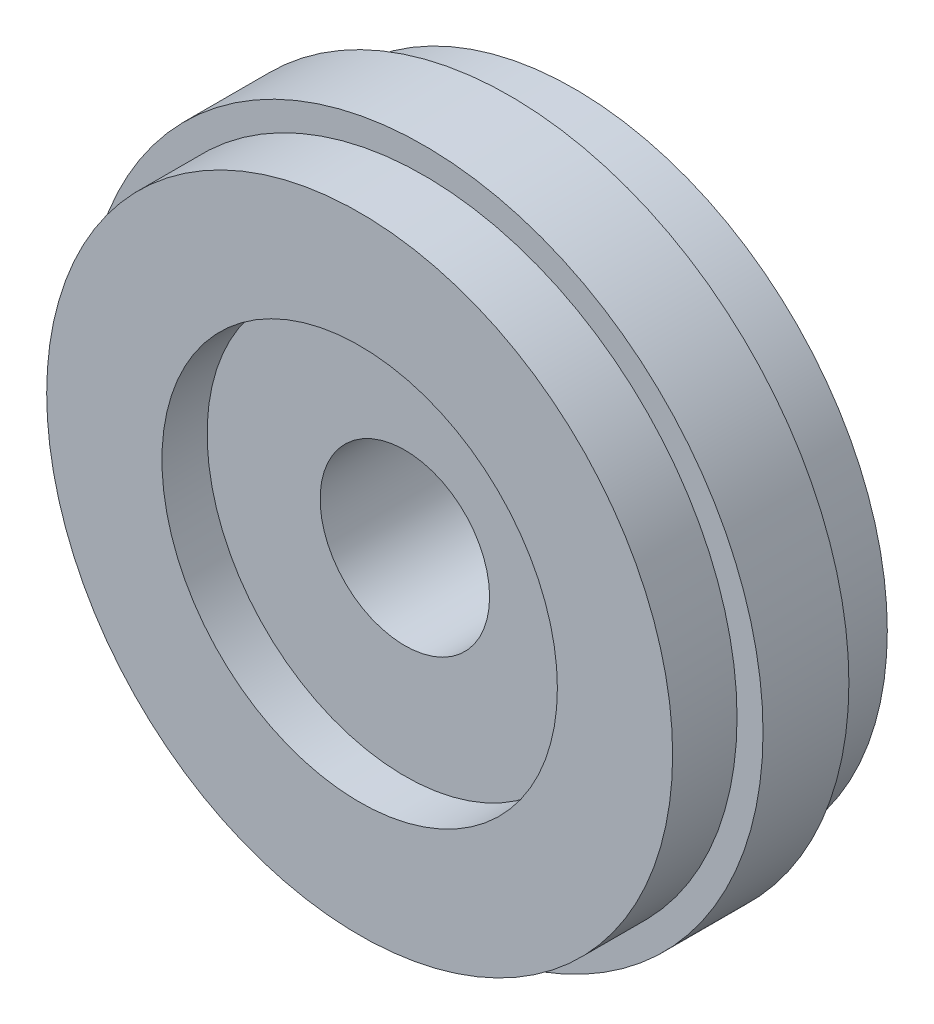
ISO-10303-21;
HEADER;
FILE_DESCRIPTION(('STEP AP214'),'2;1');
FILE_NAME('part.step','',(''),(''),'','','');
FILE_SCHEMA(('AUTOMOTIVE_DESIGN { 1 0 10303 214 1 1 1 1 }'));
ENDSEC;
DATA;
#1=APPLICATION_CONTEXT('core data for automotive mechanical design processes');
#2=APPLICATION_PROTOCOL_DEFINITION('international standard','automotive_design',2000,#1);
#3=PRODUCT_CONTEXT('',#1,'mechanical');
#4=PRODUCT('Part','Part','',(#3));
#5=PRODUCT_RELATED_PRODUCT_CATEGORY('part','',(#4));
#6=PRODUCT_DEFINITION_FORMATION('','',#4);
#7=PRODUCT_DEFINITION_CONTEXT('part definition',#1,'design');
#8=PRODUCT_DEFINITION('design','',#6,#7);
#9=PRODUCT_DEFINITION_SHAPE('','',#8);
#10=(LENGTH_UNIT() NAMED_UNIT(*) SI_UNIT(.MILLI.,.METRE.));
#11=(NAMED_UNIT(*) PLANE_ANGLE_UNIT() SI_UNIT($,.RADIAN.));
#12=(NAMED_UNIT(*) SI_UNIT($,.STERADIAN.) SOLID_ANGLE_UNIT());
#13=UNCERTAINTY_MEASURE_WITH_UNIT(LENGTH_MEASURE(1.E-05),#10,'distance_accuracy_value','');
#14=(GEOMETRIC_REPRESENTATION_CONTEXT(3) GLOBAL_UNCERTAINTY_ASSIGNED_CONTEXT((#13)) GLOBAL_UNIT_ASSIGNED_CONTEXT((#10,
#11,#12)) REPRESENTATION_CONTEXT('',''));
#15=CARTESIAN_POINT('',(0.,0.,0.));
#16=DIRECTION('',(0.,0.,1.));
#17=DIRECTION('',(1.,0.,0.));
#18=AXIS2_PLACEMENT_3D('',#15,#16,#17);
#19=CARTESIAN_POINT('',(0.,14.5,-9.5));
#20=DIRECTION('',(0.,0.,1.));
#21=DIRECTION('',(1.,0.,0.));
#22=AXIS2_PLACEMENT_3D('',#19,#20,#21);
#23=PLANE('',#22);
#24=CARTESIAN_POINT('',(0.,0.,-9.5));
#25=DIRECTION('',(0.,0.,1.));
#26=DIRECTION('',(1.,0.,0.));
#27=AXIS2_PLACEMENT_3D('',#24,#25,#26);
#28=CIRCLE('',#27,14.5);
#29=CARTESIAN_POINT('',(14.5,0.,-9.5));
#30=VERTEX_POINT('',#29);
#31=EDGE_CURVE('E8',#30,#30,#28,.T.);
#32=ORIENTED_EDGE('',*,*,#31,.T.);
#33=EDGE_LOOP('',(#32));
#34=FACE_BOUND('',#33,.T.);
#35=CARTESIAN_POINT('',(0.,0.,-9.5));
#36=DIRECTION('',(0.,0.,1.));
#37=DIRECTION('',(1.,0.,0.));
#38=AXIS2_PLACEMENT_3D('',#35,#36,#37);
#39=CIRCLE('',#38,27.7);
#40=CARTESIAN_POINT('',(27.7,0.,-9.5));
#41=VERTEX_POINT('',#40);
#42=EDGE_CURVE('E15',#41,#41,#39,.T.);
#43=ORIENTED_EDGE('',*,*,#42,.F.);
#44=EDGE_LOOP('',(#43));
#45=FACE_BOUND('',#44,.T.);
#46=ADVANCED_FACE('F12',(#34,#45),#23,.F.);
#47=CARTESIAN_POINT('',(0.,30.,9.5));
#48=DIRECTION('',(0.,0.,-1.));
#49=DIRECTION('',(-1.,0.,0.));
#50=AXIS2_PLACEMENT_3D('',#47,#48,#49);
#51=PLANE('',#50);
#52=CARTESIAN_POINT('',(0.,0.,9.5));
#53=DIRECTION('',(0.,0.,1.));
#54=DIRECTION('',(1.,0.,0.));
#55=AXIS2_PLACEMENT_3D('',#52,#53,#54);
#56=CIRCLE('',#55,17.5);
#57=CARTESIAN_POINT('',(17.5,0.,9.5));
#58=VERTEX_POINT('',#57);
#59=EDGE_CURVE('E33',#58,#58,#56,.T.);
#60=ORIENTED_EDGE('',*,*,#59,.F.);
#61=EDGE_LOOP('',(#60));
#62=FACE_BOUND('',#61,.T.);
#63=CARTESIAN_POINT('',(0.,0.,9.5));
#64=DIRECTION('',(0.,0.,-1.));
#65=DIRECTION('',(-1.,0.,0.));
#66=AXIS2_PLACEMENT_3D('',#63,#64,#65);
#67=CIRCLE('',#66,27.7);
#68=CARTESIAN_POINT('',(-27.7,0.,9.5));
#69=VERTEX_POINT('',#68);
#70=EDGE_CURVE('E27',#69,#69,#67,.T.);
#71=ORIENTED_EDGE('',*,*,#70,.F.);
#72=EDGE_LOOP('',(#71));
#73=FACE_BOUND('',#72,.T.);
#74=ADVANCED_FACE('F75',(#62,#73),#51,.F.);
#75=CARTESIAN_POINT('',(0.,0.,11.7217562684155));
#76=DIRECTION('',(0.,0.,1.));
#77=DIRECTION('',(1.,0.,0.));
#78=AXIS2_PLACEMENT_3D('',#75,#76,#77);
#79=CYLINDRICAL_SURFACE('',#78,14.5);
#80=ORIENTED_EDGE('',*,*,#31,.F.);
#81=EDGE_LOOP('',(#80));
#82=FACE_BOUND('',#81,.T.);
#83=CARTESIAN_POINT('',(0.,0.,-5.5));
#84=DIRECTION('',(0.,0.,1.));
#85=DIRECTION('',(1.,0.,0.));
#86=AXIS2_PLACEMENT_3D('',#83,#84,#85);
#87=CIRCLE('',#86,14.5);
#88=CARTESIAN_POINT('',(14.5,0.,-5.5));
#89=VERTEX_POINT('',#88);
#90=EDGE_CURVE('E19',#89,#89,#87,.T.);
#91=ORIENTED_EDGE('',*,*,#90,.T.);
#92=EDGE_LOOP('',(#91));
#93=FACE_BOUND('',#92,.T.);
#94=ADVANCED_FACE('F78',(#82,#93),#79,.F.);
#95=CARTESIAN_POINT('',(0.,7.5,-5.5));
#96=DIRECTION('',(0.,0.,1.));
#97=DIRECTION('',(1.,0.,0.));
#98=AXIS2_PLACEMENT_3D('',#95,#96,#97);
#99=PLANE('',#98);
#100=ORIENTED_EDGE('',*,*,#90,.F.);
#101=EDGE_LOOP('',(#100));
#102=FACE_BOUND('',#101,.T.);
#103=CARTESIAN_POINT('',(0.,0.,-5.5));
#104=DIRECTION('',(0.,0.,1.));
#105=DIRECTION('',(1.,0.,0.));
#106=AXIS2_PLACEMENT_3D('',#103,#104,#105);
#107=CIRCLE('',#106,7.5);
#108=CARTESIAN_POINT('',(7.5,0.,-5.5));
#109=VERTEX_POINT('',#108);
#110=EDGE_CURVE('E24',#109,#109,#107,.T.);
#111=ORIENTED_EDGE('',*,*,#110,.T.);
#112=EDGE_LOOP('',(#111));
#113=FACE_BOUND('',#112,.T.);
#114=ADVANCED_FACE('F54',(#102,#113),#99,.F.);
#115=CARTESIAN_POINT('',(0.,0.,11.7217562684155));
#116=DIRECTION('',(0.,0.,1.));
#117=DIRECTION('',(1.,0.,0.));
#118=AXIS2_PLACEMENT_3D('',#115,#116,#117);
#119=CYLINDRICAL_SURFACE('',#118,7.5);
#120=ORIENTED_EDGE('',*,*,#110,.F.);
#121=EDGE_LOOP('',(#120));
#122=FACE_BOUND('',#121,.T.);
#123=CARTESIAN_POINT('',(0.,0.,5.5));
#124=DIRECTION('',(0.,0.,1.));
#125=DIRECTION('',(1.,0.,0.));
#126=AXIS2_PLACEMENT_3D('',#123,#124,#125);
#127=CIRCLE('',#126,7.5);
#128=CARTESIAN_POINT('',(7.5,0.,5.5));
#129=VERTEX_POINT('',#128);
#130=EDGE_CURVE('E49',#129,#129,#127,.T.);
#131=ORIENTED_EDGE('',*,*,#130,.T.);
#132=EDGE_LOOP('',(#131));
#133=FACE_BOUND('',#132,.T.);
#134=ADVANCED_FACE('F56',(#122,#133),#119,.F.);
#135=CARTESIAN_POINT('',(0.,17.5,5.5));
#136=DIRECTION('',(0.,0.,-1.));
#137=DIRECTION('',(-1.,0.,0.));
#138=AXIS2_PLACEMENT_3D('',#135,#136,#137);
#139=PLANE('',#138);
#140=ORIENTED_EDGE('',*,*,#130,.F.);
#141=EDGE_LOOP('',(#140));
#142=FACE_BOUND('',#141,.T.);
#143=CARTESIAN_POINT('',(0.,0.,5.5));
#144=DIRECTION('',(0.,0.,1.));
#145=DIRECTION('',(1.,0.,0.));
#146=AXIS2_PLACEMENT_3D('',#143,#144,#145);
#147=CIRCLE('',#146,17.5);
#148=CARTESIAN_POINT('',(17.5,0.,5.5));
#149=VERTEX_POINT('',#148);
#150=EDGE_CURVE('E46',#149,#149,#147,.T.);
#151=ORIENTED_EDGE('',*,*,#150,.T.);
#152=EDGE_LOOP('',(#151));
#153=FACE_BOUND('',#152,.T.);
#154=ADVANCED_FACE('F59',(#142,#153),#139,.F.);
#155=CARTESIAN_POINT('',(0.,0.,11.7217562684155));
#156=DIRECTION('',(0.,0.,1.));
#157=DIRECTION('',(1.,0.,0.));
#158=AXIS2_PLACEMENT_3D('',#155,#156,#157);
#159=CYLINDRICAL_SURFACE('',#158,17.5);
#160=ORIENTED_EDGE('',*,*,#150,.F.);
#161=EDGE_LOOP('',(#160));
#162=FACE_BOUND('',#161,.T.);
#163=ORIENTED_EDGE('',*,*,#59,.T.);
#164=EDGE_LOOP('',(#163));
#165=FACE_BOUND('',#164,.T.);
#166=ADVANCED_FACE('F65',(#162,#165),#159,.F.);
#167=CARTESIAN_POINT('',(0.,0.,18.0891412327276));
#168=DIRECTION('',(0.,0.,1.));
#169=DIRECTION('',(1.,0.,0.));
#170=AXIS2_PLACEMENT_3D('',#167,#168,#169);
#171=CYLINDRICAL_SURFACE('',#170,27.7);
#172=CARTESIAN_POINT('',(0.,0.,-3.8));
#173=DIRECTION('',(0.,0.,1.));
#174=DIRECTION('',(1.,0.,0.));
#175=AXIS2_PLACEMENT_3D('',#172,#173,#174);
#176=CIRCLE('',#175,27.7);
#177=CARTESIAN_POINT('',(27.7,0.,-3.8));
#178=VERTEX_POINT('',#177);
#179=EDGE_CURVE('E35',#178,#178,#176,.T.);
#180=ORIENTED_EDGE('',*,*,#179,.F.);
#181=EDGE_LOOP('',(#180));
#182=FACE_BOUND('',#181,.T.);
#183=ORIENTED_EDGE('',*,*,#42,.T.);
#184=EDGE_LOOP('',(#183));
#185=FACE_BOUND('',#184,.T.);
#186=ADVANCED_FACE('F71',(#182,#185),#171,.T.);
#187=CARTESIAN_POINT('',(0.,0.,18.0891412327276));
#188=DIRECTION('',(0.,0.,1.));
#189=DIRECTION('',(1.,0.,0.));
#190=AXIS2_PLACEMENT_3D('',#187,#188,#189);
#191=CYLINDRICAL_SURFACE('',#190,27.7);
#192=CARTESIAN_POINT('',(0.,0.,3.8));
#193=DIRECTION('',(0.,0.,1.));
#194=DIRECTION('',(1.,0.,0.));
#195=AXIS2_PLACEMENT_3D('',#192,#193,#194);
#196=CIRCLE('',#195,27.7);
#197=CARTESIAN_POINT('',(27.7,0.,3.8));
#198=VERTEX_POINT('',#197);
#199=EDGE_CURVE('E40',#198,#198,#196,.T.);
#200=ORIENTED_EDGE('',*,*,#199,.T.);
#201=EDGE_LOOP('',(#200));
#202=FACE_BOUND('',#201,.T.);
#203=ORIENTED_EDGE('',*,*,#70,.T.);
#204=EDGE_LOOP('',(#203));
#205=FACE_BOUND('',#204,.T.);
#206=ADVANCED_FACE('F127',(#202,#205),#191,.T.);
#207=CARTESIAN_POINT('',(0.,0.,18.0891412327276));
#208=DIRECTION('',(0.,0.,1.));
#209=DIRECTION('',(1.,0.,0.));
#210=AXIS2_PLACEMENT_3D('',#207,#208,#209);
#211=CYLINDRICAL_SURFACE('',#210,30.);
#212=CARTESIAN_POINT('',(0.,0.,-3.8));
#213=DIRECTION('',(0.,0.,1.));
#214=DIRECTION('',(1.,0.,0.));
#215=AXIS2_PLACEMENT_3D('',#212,#213,#214);
#216=CIRCLE('',#215,30.);
#217=CARTESIAN_POINT('',(30.,0.,-3.8));
#218=VERTEX_POINT('',#217);
#219=EDGE_CURVE('E29',#218,#218,#216,.T.);
#220=ORIENTED_EDGE('',*,*,#219,.T.);
#221=EDGE_LOOP('',(#220));
#222=FACE_BOUND('',#221,.T.);
#223=CARTESIAN_POINT('',(0.,0.,3.8));
#224=DIRECTION('',(0.,0.,1.));
#225=DIRECTION('',(1.,0.,0.));
#226=AXIS2_PLACEMENT_3D('',#223,#224,#225);
#227=CIRCLE('',#226,30.);
#228=CARTESIAN_POINT('',(30.,0.,3.8));
#229=VERTEX_POINT('',#228);
#230=EDGE_CURVE('E189',#229,#229,#227,.T.);
#231=ORIENTED_EDGE('',*,*,#230,.F.);
#232=EDGE_LOOP('',(#231));
#233=FACE_BOUND('',#232,.T.);
#234=ADVANCED_FACE('F88',(#222,#233),#211,.T.);
#235=CARTESIAN_POINT('',(0.,27.7,-3.8));
#236=DIRECTION('',(0.,0.,-1.));
#237=DIRECTION('',(-1.,0.,0.));
#238=AXIS2_PLACEMENT_3D('',#235,#236,#237);
#239=PLANE('',#238);
#240=ORIENTED_EDGE('',*,*,#179,.T.);
#241=EDGE_LOOP('',(#240));
#242=FACE_BOUND('',#241,.T.);
#243=ORIENTED_EDGE('',*,*,#219,.F.);
#244=EDGE_LOOP('',(#243));
#245=FACE_BOUND('',#244,.T.);
#246=ADVANCED_FACE('F144',(#242,#245),#239,.T.);
#247=CARTESIAN_POINT('',(0.,30.,3.8));
#248=DIRECTION('',(0.,0.,1.));
#249=DIRECTION('',(1.,0.,0.));
#250=AXIS2_PLACEMENT_3D('',#247,#248,#249);
#251=PLANE('',#250);
#252=ORIENTED_EDGE('',*,*,#230,.T.);
#253=EDGE_LOOP('',(#252));
#254=FACE_BOUND('',#253,.T.);
#255=ORIENTED_EDGE('',*,*,#199,.F.);
#256=EDGE_LOOP('',(#255));
#257=FACE_BOUND('',#256,.T.);
#258=ADVANCED_FACE('F151',(#254,#257),#251,.T.);
#259=CLOSED_SHELL('',(#46,#74,#94,#114,#134,#154,#166,#186,#206,#234,#246,#258));
#260=MANIFOLD_SOLID_BREP('B1',#259);
#261=ADVANCED_BREP_SHAPE_REPRESENTATION('',(#18,#260),#14);
#262=SHAPE_DEFINITION_REPRESENTATION(#9,#261);
ENDSEC;
END-ISO-10303-21;
